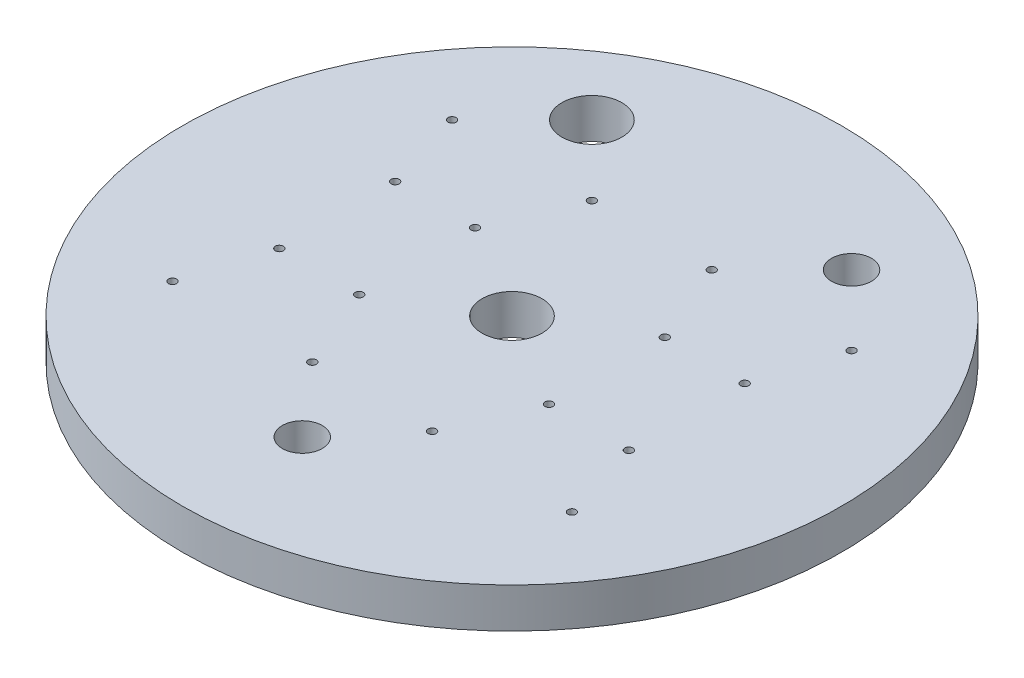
from build123d import *

# Parameters (mm, degrees)
SKETCH1_R                        = 209.55
BOSS_EXTRUDE1_DEPTH              = 12.7
F_3_8_16_TAPPED_HOLE1_D          = 7.9375
F_3_8_16_TAPPED_HOLE1_DEPTH      = 19.304
F_3_8_16_TAPPED_HOLE1_TIP        = 2.384665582
CUT_EXTRUDE1_REACH               = 299.435
SKETCH4_R                        = 19.05
CUT_EXTRUDE2_REACH               = 299.435
SKETCH5_R                        = 12.7
CUT_EXTRUDE3_REACH               = 299.435
SKETCH6_R                        = 19.05
F_1_4_20_TAPPED_HOLE1_AT_2_COUNT = 2
F_1_4_20_TAPPED_HOLE1_AT_2_PITCH = 50.8
F_1_4_20_TAPPED_HOLE2_AT_2_COUNT = 2
F_1_4_20_TAPPED_HOLE2_AT_2_PITCH = 88.9
F_1_4_20_TAPPED_HOLE3_AT_2_COUNT = 2
F_1_4_20_TAPPED_HOLE3_AT_2_PITCH = 50.8
F_1_4_20_TAPPED_HOLE3_AT_3_COUNT = 2
F_1_4_20_TAPPED_HOLE3_AT_3_PITCH = 71.842048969
F_1_4_20_TAPPED_HOLE3_AT_4_COUNT = 2
F_1_4_20_TAPPED_HOLE3_AT_4_PITCH = 50.8


with BuildPart() as part:
    # Sketch1 → Boss-Extrude1 (new, symmetric)
    with BuildSketch(Plane(origin=(0, 0, 0), x_dir=(1, 0, 0), z_dir=(0, 1, 0))):
        with Locations(Location((0, 0, 0), (0, 0, 270))):
            Circle(SKETCH1_R)
    extrude(amount=BOSS_EXTRUDE1_DEPTH, both=True)

    # 3_8-16 Tapped Hole1
    with Locations(Plane(origin=(0, -12.7, 0), x_dir=(-1, 0, 0), z_dir=(0, -1, 0))):
        with Locations((88.9, -88.9), (-88.9, -88.9), (-88.9, 88.9), (88.9, 88.9)):
            Hole(F_3_8_16_TAPPED_HOLE1_D / 2, depth=F_3_8_16_TAPPED_HOLE1_DEPTH)
            with Locations((0, 0, -(F_3_8_16_TAPPED_HOLE1_DEPTH + F_3_8_16_TAPPED_HOLE1_TIP / 2))):  # 118° drill point
                Cone(0, F_3_8_16_TAPPED_HOLE1_D / 2, F_3_8_16_TAPPED_HOLE1_TIP, mode=Mode.SUBTRACT)

    # Sketch4 → Cut-Extrude1 (cut, up to next)
    with BuildSketch(Plane(origin=(0, 12.7, 0), x_dir=(1, 0, 0), z_dir=(0, 1, 0)), mode=Mode.PRIVATE) as cut_extrude1_sk1:
        with Locations(Location((0, 0, 0), (0, 0, 270))):
            Circle(SKETCH4_R)
    cut_extrude1_tool1 = extrude(cut_extrude1_sk1.sketch, amount=-CUT_EXTRUDE1_REACH, mode=Mode.PRIVATE) & part.part
    add(cut_extrude1_tool1.solids().sort_by_distance((0, 12.7, 0))[0], mode=Mode.SUBTRACT)

    # Sketch5 → Cut-Extrude2 (cut, up to next)
    with BuildSketch(Plane(origin=(0, 12.7, 0), x_dir=(1, 0, 0), z_dir=(0, 1, 0)), mode=Mode.PRIVATE) as cut_extrude2_sk1:
        with Locations(Location((0, -133.35, 0), (0, 0, 270))):
            Circle(SKETCH5_R)
    cut_extrude2_tool1 = extrude(cut_extrude2_sk1.sketch, amount=-CUT_EXTRUDE2_REACH, mode=Mode.PRIVATE) & part.part
    # Sketch5 → Cut-Extrude2 (cut, up to next)
    with BuildSketch(Plane(origin=(0, 12.7, 0), x_dir=(1, 0, 0), z_dir=(0, 1, 0)), mode=Mode.PRIVATE) as cut_extrude2_sk2:
        with Locations(Location((82.55, 133.35, 0), (0, 0, 270))):
            Circle(SKETCH5_R)
    cut_extrude2_tool2 = extrude(cut_extrude2_sk2.sketch, amount=-CUT_EXTRUDE2_REACH, mode=Mode.PRIVATE) & part.part
    add(cut_extrude2_tool1.solids().sort_by_distance((0, 12.7, 133.35))[0], mode=Mode.SUBTRACT)
    add(cut_extrude2_tool2.solids().sort_by_distance((82.55, 12.7, -133.35))[0], mode=Mode.SUBTRACT)

    # Sketch6 → Cut-Extrude3 (cut, up to next)
    with BuildSketch(Plane(origin=(0, 12.7, 0), x_dir=(1, 0, 0), z_dir=(0, 1, 0)), mode=Mode.PRIVATE) as cut_extrude3_sk1:
        with Locations(Location((-82.55, 133.35, 0), (0, 0, 270))):
            Circle(SKETCH6_R)
    cut_extrude3_tool1 = extrude(cut_extrude3_sk1.sketch, amount=-CUT_EXTRUDE3_REACH, mode=Mode.PRIVATE) & part.part
    add(cut_extrude3_tool1.solids().sort_by_distance((-82.55, 12.7, -133.35))[0], mode=Mode.SUBTRACT)

    # Sketch7 → 1_4-20 Tapped Hole1 (revolve, cut)
    with BuildSketch(Plane(origin=(-111.125, 12.7, -36.83), x_dir=(0, 0, 1), z_dir=(1, 0, 0))):
        Polygon((0, 0), (0, 20.583816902), (2.5527, 19.05), (2.5527, 0), align=None)
    f_1_4_20_tapped_hole1 = revolve(axis=Axis((-111.125, 19.05, -36.83), (0, -1, 0)), mode=Mode.SUBTRACT)

    # 1_4-20 Tapped Hole1 at 2: 1_4-20 Tapped Hole1 ×2
    with Locations(*[(i * F_1_4_20_TAPPED_HOLE1_AT_2_PITCH, 0, 0) for i in range(1, F_1_4_20_TAPPED_HOLE1_AT_2_COUNT)]):
        add(f_1_4_20_tapped_hole1, mode=Mode.SUBTRACT)

    # Sketch9 → 1_4-20 Tapped Hole2 (revolve, cut)
    with BuildSketch(Plane(origin=(-38.1, 12.7, -88.9), x_dir=(0, 0, 1), z_dir=(1, 0, 0))):
        Polygon((0, 0), (0, 20.583816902), (2.5527, 19.05), (2.5527, 0), align=None)
    f_1_4_20_tapped_hole2 = revolve(axis=Axis((-38.1, 19.05, -88.9), (0, -1, 0)), mode=Mode.SUBTRACT)

    # 1_4-20 Tapped Hole2 at 2: 1_4-20 Tapped Hole2 ×2
    with Locations(*[(-i * F_1_4_20_TAPPED_HOLE2_AT_2_PITCH, 0, 0) for i in range(1, F_1_4_20_TAPPED_HOLE2_AT_2_COUNT)]):
        add(f_1_4_20_tapped_hole2, mode=Mode.SUBTRACT)

    # Mirror1: 1_4-20 Tapped Hole1, 1_4-20 Tapped Hole2 across plane
    add(f_1_4_20_tapped_hole1.mirror(Plane(origin=(0, 0, 0), x_dir=(0, 0, 1), z_dir=(1, 0, 0))), mode=Mode.SUBTRACT)
    add(f_1_4_20_tapped_hole2.mirror(Plane(origin=(0, 0, 0), x_dir=(0, 0, 1), z_dir=(1, 0, 0))), mode=Mode.SUBTRACT)

    # Mirror1 copy 1 sketch → Mirror1 copy 1 (revolve, cut)
    with BuildSketch(Plane(origin=(60.325, 12.7, -36.83), x_dir=(0, 0, 1), z_dir=(-1, 0, 0))):
        Polygon((0, 0), (0, -20.583816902), (2.5527, -19.05), (2.5527, 0), align=None)
    revolve(axis=Axis((60.325, 19.05, -36.83), (0, 1, 0)), mode=Mode.SUBTRACT)

    # Mirror1 copy 2 sketch → Mirror1 copy 2 (revolve, cut)
    with BuildSketch(Plane(origin=(127, 12.7, -88.9), x_dir=(0, 0, 1), z_dir=(-1, 0, 0))):
        Polygon((0, 0), (0, -20.583816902), (2.5527, -19.05), (2.5527, 0), align=None)
    revolve(axis=Axis((127, 19.05, -88.9), (0, 1, 0)), mode=Mode.SUBTRACT)

    # Mirror2: 1_4-20 Tapped Hole1, 1_4-20 Tapped Hole2 across plane
    add(f_1_4_20_tapped_hole1.mirror(Plane.XY), mode=Mode.SUBTRACT)
    add(f_1_4_20_tapped_hole2.mirror(Plane.XY), mode=Mode.SUBTRACT)

    # Mirror2 copy 1 sketch → Mirror2 copy 1 (revolve, cut)
    with BuildSketch(Plane(origin=(-60.325, 12.7, 36.83), x_dir=(0, 0, -1), z_dir=(1, 0, 0))):
        Polygon((0, 0), (0, -20.583816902), (2.5527, -19.05), (2.5527, 0), align=None)
    revolve(axis=Axis((-60.325, 19.05, 36.83), (0, 1, 0)), mode=Mode.SUBTRACT)

    # Mirror2 copy 2 sketch → Mirror2 copy 2 (revolve, cut)
    with BuildSketch(Plane(origin=(-127, 12.7, 88.9), x_dir=(0, 0, -1), z_dir=(1, 0, 0))):
        Polygon((0, 0), (0, -20.583816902), (2.5527, -19.05), (2.5527, 0), align=None)
    revolve(axis=Axis((-127, 19.05, 88.9), (0, 1, 0)), mode=Mode.SUBTRACT)

    # Mirror2 copy 3 sketch → Mirror2 copy 3 (revolve, cut)
    with BuildSketch(Plane(origin=(111.125, 12.7, 36.83), x_dir=(0, 0, -1), z_dir=(-1, 0, 0))):
        Polygon((0, 0), (0, 20.583816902), (2.5527, 19.05), (2.5527, 0), align=None)
    revolve(axis=Axis((111.125, 19.05, 36.83), (0, -1, 0)), mode=Mode.SUBTRACT)

    # Mirror2 copy 4 sketch → Mirror2 copy 4 (revolve, cut)
    with BuildSketch(Plane(origin=(38.1, 12.7, 88.9), x_dir=(0, 0, -1), z_dir=(-1, 0, 0))):
        Polygon((0, 0), (0, 20.583816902), (2.5527, 19.05), (2.5527, 0), align=None)
    revolve(axis=Axis((38.1, 19.05, 88.9), (0, -1, 0)), mode=Mode.SUBTRACT)

    # Mirror2 copy 5 sketch → Mirror2 copy 5 (revolve, cut)
    with BuildSketch(Plane(origin=(60.325, 12.7, 36.83), x_dir=(0, 0, -1), z_dir=(-1, 0, 0))):
        Polygon((0, 0), (0, 20.583816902), (2.5527, 19.05), (2.5527, 0), align=None)
    revolve(axis=Axis((60.325, 19.05, 36.83), (0, -1, 0)), mode=Mode.SUBTRACT)

    # Mirror2 copy 6 sketch → Mirror2 copy 6 (revolve, cut)
    with BuildSketch(Plane(origin=(127, 12.7, 88.9), x_dir=(0, 0, -1), z_dir=(-1, 0, 0))):
        Polygon((0, 0), (0, 20.583816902), (2.5527, 19.05), (2.5527, 0), align=None)
    revolve(axis=Axis((127, 19.05, 88.9), (0, -1, 0)), mode=Mode.SUBTRACT)

    # Sketch12 → 1_4-20 Tapped Hole3 (revolve, cut)
    with BuildSketch(Plane(origin=(-177.8, -12.7, 25.4), x_dir=(0, 0, -1), z_dir=(1, 0, 0))):
        Polygon((0, 0), (0, 20.583816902), (2.5527, 19.05), (2.5527, 0), align=None)
    f_1_4_20_tapped_hole3 = revolve(axis=Axis((-177.8, -19.05, 25.4), (0, 1, 0)), mode=Mode.SUBTRACT)

    # 1_4-20 Tapped Hole3 at 2: 1_4-20 Tapped Hole3 ×2
    with Locations(*[(i * F_1_4_20_TAPPED_HOLE3_AT_2_PITCH, 0, 0) for i in range(1, F_1_4_20_TAPPED_HOLE3_AT_2_COUNT)]):
        add(f_1_4_20_tapped_hole3, mode=Mode.SUBTRACT)

    # 1_4-20 Tapped Hole3 at 3: 1_4-20 Tapped Hole3 ×2
    with Locations(*[Vector(0.7071067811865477, 0, -0.7071067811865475) * (i * F_1_4_20_TAPPED_HOLE3_AT_3_PITCH) for i in range(1, F_1_4_20_TAPPED_HOLE3_AT_3_COUNT)]):
        add(f_1_4_20_tapped_hole3, mode=Mode.SUBTRACT)

    # 1_4-20 Tapped Hole3 at 4: 1_4-20 Tapped Hole3 ×2
    with Locations(*[(0, 0, -i * F_1_4_20_TAPPED_HOLE3_AT_4_PITCH) for i in range(1, F_1_4_20_TAPPED_HOLE3_AT_4_COUNT)]):
        add(f_1_4_20_tapped_hole3, mode=Mode.SUBTRACT)

    # Mirror3: 1_4-20 Tapped Hole3 across plane
    add(f_1_4_20_tapped_hole3.mirror(Plane(origin=(0, 0, 0), x_dir=(0, 0, 1), z_dir=(1, 0, 0))), mode=Mode.SUBTRACT)

    # Mirror3 copy 1 sketch → Mirror3 copy 1 (revolve, cut)
    with BuildSketch(Plane(origin=(127, -12.7, 25.4), x_dir=(0, 0, -1), z_dir=(-1, 0, 0))):
        Polygon((0, 0), (0, -20.583816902), (2.5527, -19.05), (2.5527, 0), align=None)
    revolve(axis=Axis((127, -19.05, 25.4), (0, -1, 0)), mode=Mode.SUBTRACT)

    # Mirror3 copy 2 sketch → Mirror3 copy 2 (revolve, cut)
    with BuildSketch(Plane(origin=(127, -12.7, -25.4), x_dir=(0, 0, -1), z_dir=(-1, 0, 0))):
        Polygon((0, 0), (0, -20.583816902), (2.5527, -19.05), (2.5527, 0), align=None)
    revolve(axis=Axis((127, -19.05, -25.4), (0, -1, 0)), mode=Mode.SUBTRACT)

    # Mirror3 copy 3 sketch → Mirror3 copy 3 (revolve, cut)
    with BuildSketch(Plane(origin=(177.8, -12.7, -25.4), x_dir=(0, 0, -1), z_dir=(-1, 0, 0))):
        Polygon((0, 0), (0, -20.583816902), (2.5527, -19.05), (2.5527, 0), align=None)
    revolve(axis=Axis((177.8, -19.05, -25.4), (0, -1, 0)), mode=Mode.SUBTRACT)


solid = part.part
